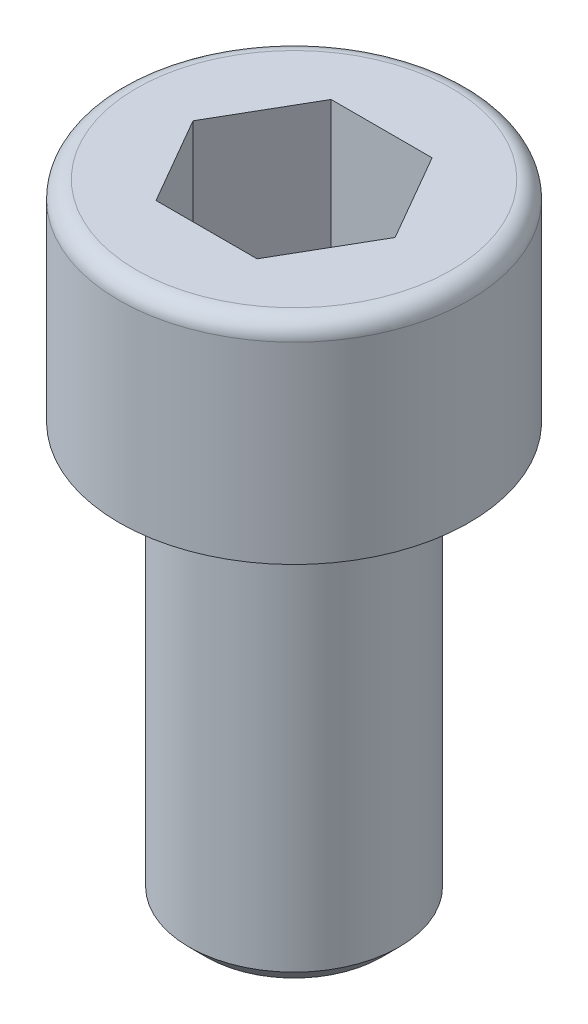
ISO-10303-21;
HEADER;
FILE_DESCRIPTION(('STEP AP214'),'2;1');
FILE_NAME('part.step','',(''),(''),'','','');
FILE_SCHEMA(('AUTOMOTIVE_DESIGN { 1 0 10303 214 1 1 1 1 }'));
ENDSEC;
DATA;
#1=APPLICATION_CONTEXT('core data for automotive mechanical design processes');
#2=APPLICATION_PROTOCOL_DEFINITION('international standard','automotive_design',2000,#1);
#3=PRODUCT_CONTEXT('',#1,'mechanical');
#4=PRODUCT('Part','Part','',(#3));
#5=PRODUCT_RELATED_PRODUCT_CATEGORY('part','',(#4));
#6=PRODUCT_DEFINITION_FORMATION('','',#4);
#7=PRODUCT_DEFINITION_CONTEXT('part definition',#1,'design');
#8=PRODUCT_DEFINITION('design','',#6,#7);
#9=PRODUCT_DEFINITION_SHAPE('','',#8);
#10=(LENGTH_UNIT() NAMED_UNIT(*) SI_UNIT(.MILLI.,.METRE.));
#11=(NAMED_UNIT(*) PLANE_ANGLE_UNIT() SI_UNIT($,.RADIAN.));
#12=(NAMED_UNIT(*) SI_UNIT($,.STERADIAN.) SOLID_ANGLE_UNIT());
#13=UNCERTAINTY_MEASURE_WITH_UNIT(LENGTH_MEASURE(1.E-05),#10,'distance_accuracy_value','');
#14=(GEOMETRIC_REPRESENTATION_CONTEXT(3) GLOBAL_UNCERTAINTY_ASSIGNED_CONTEXT((#13)) GLOBAL_UNIT_ASSIGNED_CONTEXT((#10,
#11,#12)) REPRESENTATION_CONTEXT('',''));
#15=CARTESIAN_POINT('',(0.,0.,0.));
#16=DIRECTION('',(0.,0.,1.));
#17=DIRECTION('',(1.,0.,0.));
#18=AXIS2_PLACEMENT_3D('',#15,#16,#17);
#19=CARTESIAN_POINT('',(-1.11022302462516E-13,18.,0.));
#20=DIRECTION('',(0.,1.,0.));
#21=DIRECTION('',(0.,0.,1.));
#22=AXIS2_PLACEMENT_3D('',#19,#20,#21);
#23=PLANE('',#22);
#24=CARTESIAN_POINT('',(-1.11022302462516E-13,18.,0.));
#25=DIRECTION('',(0.,1.,0.));
#26=DIRECTION('',(0.,0.,1.));
#27=AXIS2_PLACEMENT_3D('',#24,#25,#26);
#28=CIRCLE('',#27,4.5);
#29=CARTESIAN_POINT('',(-1.17882679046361E-13,18.,4.50000000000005));
#30=VERTEX_POINT('',#29);
#31=EDGE_CURVE('E97',#30,#30,#28,.T.);
#32=ORIENTED_EDGE('',*,*,#31,.T.);
#33=EDGE_LOOP('',(#32));
#34=FACE_BOUND('',#33,.T.);
#35=DIRECTION('',(0.499999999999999,0.,0.866025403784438));
#36=VECTOR('',#35,1.);
#37=CARTESIAN_POINT('',(1.44337567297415,17.9999999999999,-2.50000000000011));
#38=LINE('',#37,#36);
#39=CARTESIAN_POINT('',(1.44337567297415,17.9999999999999,-2.50000000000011));
#40=VERTEX_POINT('',#39);
#41=CARTESIAN_POINT('',(2.88675134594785,18.0000000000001,1.0547118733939E-12));
#42=VERTEX_POINT('',#41);
#43=EDGE_CURVE('E102',#40,#42,#38,.T.);
#44=ORIENTED_EDGE('',*,*,#43,.T.);
#45=DIRECTION('',(-0.500000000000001,0.,0.866025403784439));
#46=VECTOR('',#45,1.);
#47=CARTESIAN_POINT('',(2.88675134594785,18.0000000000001,1.0547118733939E-12));
#48=LINE('',#47,#46);
#49=CARTESIAN_POINT('',(1.44337567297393,17.9999999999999,2.49999999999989));
#50=VERTEX_POINT('',#49);
#51=EDGE_CURVE('E43',#42,#50,#48,.T.);
#52=ORIENTED_EDGE('',*,*,#51,.T.);
#53=DIRECTION('',(-1.,0.,0.));
#54=VECTOR('',#53,1.);
#55=CARTESIAN_POINT('',(1.44337567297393,17.9999999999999,2.49999999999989));
#56=LINE('',#55,#54);
#57=CARTESIAN_POINT('',(-1.44337567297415,17.9999999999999,2.49999999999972));
#58=VERTEX_POINT('',#57);
#59=EDGE_CURVE('E83',#50,#58,#56,.T.);
#60=ORIENTED_EDGE('',*,*,#59,.T.);
#61=DIRECTION('',(-0.499999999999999,0.,-0.866025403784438));
#62=VECTOR('',#61,1.);
#63=CARTESIAN_POINT('',(-1.44337567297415,17.9999999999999,2.49999999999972));
#64=LINE('',#63,#62);
#65=CARTESIAN_POINT('',(-2.88675134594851,17.9999999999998,-4.44089209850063E-13));
#66=VERTEX_POINT('',#65);
#67=EDGE_CURVE('E91',#58,#66,#64,.T.);
#68=ORIENTED_EDGE('',*,*,#67,.T.);
#69=DIRECTION('',(0.500000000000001,0.,-0.866025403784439));
#70=VECTOR('',#69,1.);
#71=CARTESIAN_POINT('',(-2.88675134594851,17.9999999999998,-4.44089209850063E-13));
#72=LINE('',#71,#70);
#73=CARTESIAN_POINT('',(-1.44337567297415,18.,-2.5));
#74=VERTEX_POINT('',#73);
#75=EDGE_CURVE('E106',#66,#74,#72,.T.);
#76=ORIENTED_EDGE('',*,*,#75,.T.);
#77=DIRECTION('',(1.,0.,0.));
#78=VECTOR('',#77,1.);
#79=CARTESIAN_POINT('',(-1.44337567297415,18.,-2.5));
#80=LINE('',#79,#78);
#81=EDGE_CURVE('E109',#74,#40,#80,.T.);
#82=ORIENTED_EDGE('',*,*,#81,.T.);
#83=EDGE_LOOP('',(#44,#52,#60,#68,#76,#82));
#84=FACE_BOUND('',#83,.T.);
#85=ADVANCED_FACE('F28',(#34,#84),#23,.T.);
#86=CARTESIAN_POINT('',(-2.99999999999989,2.4980018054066E-13,-4.9960036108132E-13));
#87=DIRECTION('',(0.,-1.,0.));
#88=DIRECTION('',(0.,0.,-1.));
#89=AXIS2_PLACEMENT_3D('',#86,#87,#88);
#90=PLANE('',#89);
#91=CARTESIAN_POINT('',(0.,1.94289029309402E-13,0.));
#92=DIRECTION('',(0.,-1.,0.));
#93=DIRECTION('',(0.,0.,-1.));
#94=AXIS2_PLACEMENT_3D('',#91,#92,#93);
#95=CIRCLE('',#94,2.5);
#96=CARTESIAN_POINT('',(-1.14736926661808E-13,1.95047970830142E-13,2.50000000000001));
#97=VERTEX_POINT('',#96);
#98=EDGE_CURVE('E11',#97,#97,#95,.T.);
#99=ORIENTED_EDGE('',*,*,#98,.T.);
#100=EDGE_LOOP('',(#99));
#101=FACE_BOUND('',#100,.T.);
#102=ADVANCED_FACE('F30',(#101),#90,.T.);
#103=CARTESIAN_POINT('',(1.11022302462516E-13,50.,1.99840144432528E-12));
#104=DIRECTION('',(0.,1.,0.));
#105=DIRECTION('',(0.,0.,1.));
#106=AXIS2_PLACEMENT_3D('',#103,#104,#105);
#107=CYLINDRICAL_SURFACE('',#106,3.);
#108=CARTESIAN_POINT('',(-1.11022302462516E-13,0.500000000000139,0.));
#109=DIRECTION('',(0.,-1.,0.));
#110=DIRECTION('',(0.,0.,-1.));
#111=AXIS2_PLACEMENT_3D('',#108,#109,#110);
#112=CIRCLE('',#111,3.);
#113=CARTESIAN_POINT('',(1.16021634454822E-13,0.500000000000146,3.00000000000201));
#114=VERTEX_POINT('',#113);
#115=EDGE_CURVE('E36',#114,#114,#112,.F.);
#116=CARTESIAN_POINT('',(1.11022302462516E-13,12.,0.));
#117=DIRECTION('',(0.,1.,0.));
#118=DIRECTION('',(0.,0.,1.));
#119=AXIS2_PLACEMENT_3D('',#116,#117,#118);
#120=CIRCLE('',#119,3.);
#121=CARTESIAN_POINT('',(1.13797623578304E-13,12.,3.00000000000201));
#122=VERTEX_POINT('',#121);
#123=EDGE_CURVE('E139',#122,#122,#120,.T.);
#124=CARTESIAN_POINT('',(1.16021634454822E-13,0.500000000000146,3.00000000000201));
#125=CARTESIAN_POINT('',(1.15998467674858E-13,0.619791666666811,3.00000000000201));
#126=CARTESIAN_POINT('',(1.15975300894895E-13,0.739583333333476,3.00000000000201));
#127=CARTESIAN_POINT('',(1.15928967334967E-13,0.979166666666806,3.00000000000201));
#128=CARTESIAN_POINT('',(1.15905800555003E-13,1.09895833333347,3.00000000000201));
#129=CARTESIAN_POINT('',(1.15859466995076E-13,1.3385416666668,3.00000000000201));
#130=CARTESIAN_POINT('',(1.15836300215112E-13,1.45833333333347,3.00000000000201));
#131=CARTESIAN_POINT('',(1.15789966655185E-13,1.6979166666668,3.00000000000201));
#132=CARTESIAN_POINT('',(1.15766799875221E-13,1.81770833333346,3.00000000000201));
#133=CARTESIAN_POINT('',(1.15720466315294E-13,2.05729166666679,3.00000000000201));
#134=CARTESIAN_POINT('',(1.1569729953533E-13,2.17708333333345,3.00000000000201));
#135=CARTESIAN_POINT('',(1.15650965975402E-13,2.41666666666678,3.00000000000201));
#136=CARTESIAN_POINT('',(1.15627799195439E-13,2.53645833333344,3.00000000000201));
#137=CARTESIAN_POINT('',(1.15581465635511E-13,2.77604166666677,3.00000000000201));
#138=CARTESIAN_POINT('',(1.15558298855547E-13,2.89583333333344,3.00000000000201));
#139=CARTESIAN_POINT('',(1.1551196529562E-13,3.13541666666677,3.00000000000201));
#140=CARTESIAN_POINT('',(1.15488798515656E-13,3.25520833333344,3.00000000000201));
#141=CARTESIAN_POINT('',(1.15442464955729E-13,3.49479166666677,3.00000000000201));
#142=CARTESIAN_POINT('',(1.15419298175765E-13,3.61458333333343,3.00000000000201));
#143=CARTESIAN_POINT('',(1.15372964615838E-13,3.85416666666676,3.00000000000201));
#144=CARTESIAN_POINT('',(1.15349797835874E-13,3.97395833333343,3.00000000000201));
#145=CARTESIAN_POINT('',(1.15303464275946E-13,4.21354166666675,3.00000000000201));
#146=CARTESIAN_POINT('',(1.15280297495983E-13,4.33333333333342,3.00000000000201));
#147=CARTESIAN_POINT('',(1.15233963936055E-13,4.57291666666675,3.00000000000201));
#148=CARTESIAN_POINT('',(1.15210797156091E-13,4.69270833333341,3.00000000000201));
#149=CARTESIAN_POINT('',(1.15164463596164E-13,4.93229166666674,3.00000000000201));
#150=CARTESIAN_POINT('',(1.151412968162E-13,5.0520833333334,3.00000000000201));
#151=CARTESIAN_POINT('',(1.15094963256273E-13,5.29166666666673,3.00000000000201));
#152=CARTESIAN_POINT('',(1.15071796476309E-13,5.4114583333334,3.00000000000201));
#153=CARTESIAN_POINT('',(1.15025462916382E-13,5.65104166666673,3.00000000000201));
#154=CARTESIAN_POINT('',(1.15002296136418E-13,5.77083333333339,3.00000000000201));
#155=CARTESIAN_POINT('',(1.1495596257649E-13,6.01041666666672,3.00000000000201));
#156=CARTESIAN_POINT('',(1.14932795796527E-13,6.13020833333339,3.00000000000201));
#157=CARTESIAN_POINT('',(1.14886462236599E-13,6.36979166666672,3.00000000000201));
#158=CARTESIAN_POINT('',(1.14863295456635E-13,6.48958333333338,3.00000000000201));
#159=CARTESIAN_POINT('',(1.14816961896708E-13,6.72916666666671,3.00000000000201));
#160=CARTESIAN_POINT('',(1.14793795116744E-13,6.84895833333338,3.00000000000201));
#161=CARTESIAN_POINT('',(1.14747461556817E-13,7.08854166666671,3.00000000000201));
#162=CARTESIAN_POINT('',(1.14724294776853E-13,7.20833333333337,3.00000000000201));
#163=CARTESIAN_POINT('',(1.14677961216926E-13,7.4479166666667,3.00000000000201));
#164=CARTESIAN_POINT('',(1.14654794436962E-13,7.56770833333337,3.00000000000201));
#165=CARTESIAN_POINT('',(1.14608460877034E-13,7.8072916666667,3.00000000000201));
#166=CARTESIAN_POINT('',(1.14585294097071E-13,7.92708333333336,3.00000000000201));
#167=CARTESIAN_POINT('',(1.14538960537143E-13,8.16666666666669,3.00000000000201));
#168=CARTESIAN_POINT('',(1.14515793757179E-13,8.28645833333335,3.00000000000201));
#169=CARTESIAN_POINT('',(1.14469460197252E-13,8.52604166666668,3.00000000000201));
#170=CARTESIAN_POINT('',(1.14446293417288E-13,8.64583333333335,3.00000000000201));
#171=CARTESIAN_POINT('',(1.14399959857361E-13,8.88541666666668,3.00000000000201));
#172=CARTESIAN_POINT('',(1.14376793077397E-13,9.00520833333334,3.00000000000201));
#173=CARTESIAN_POINT('',(1.1433045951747E-13,9.24479166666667,3.00000000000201));
#174=CARTESIAN_POINT('',(1.14307292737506E-13,9.36458333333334,3.00000000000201));
#175=CARTESIAN_POINT('',(1.14260959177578E-13,9.60416666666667,3.00000000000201));
#176=CARTESIAN_POINT('',(1.14237792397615E-13,9.72395833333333,3.00000000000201));
#177=CARTESIAN_POINT('',(1.14191458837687E-13,9.96354166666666,3.00000000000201));
#178=CARTESIAN_POINT('',(1.14168292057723E-13,10.0833333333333,3.00000000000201));
#179=CARTESIAN_POINT('',(1.14121958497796E-13,10.3229166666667,3.00000000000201));
#180=CARTESIAN_POINT('',(1.14098791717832E-13,10.4427083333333,3.00000000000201));
#181=CARTESIAN_POINT('',(1.14052458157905E-13,10.6822916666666,3.00000000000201));
#182=CARTESIAN_POINT('',(1.14029291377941E-13,10.8020833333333,3.00000000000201));
#183=CARTESIAN_POINT('',(1.13982957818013E-13,11.0416666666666,3.00000000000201));
#184=CARTESIAN_POINT('',(1.1395979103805E-13,11.1614583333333,3.00000000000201));
#185=CARTESIAN_POINT('',(1.13913457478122E-13,11.4010416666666,3.00000000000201));
#186=CARTESIAN_POINT('',(1.13890290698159E-13,11.5208333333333,3.00000000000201));
#187=CARTESIAN_POINT('',(1.13843957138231E-13,11.7604166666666,3.00000000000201));
#188=CARTESIAN_POINT('',(1.13820790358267E-13,11.8802083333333,3.00000000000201));
#189=CARTESIAN_POINT('',(1.13797623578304E-13,12.,3.00000000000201));
#190=B_SPLINE_CURVE_WITH_KNOTS('',3,(#124,#125,#126,#127,#128,#129,#130,#131,#132,#133,#134,
#135,#136,#137,#138,#139,#140,#141,#142,#143,#144,#145,#146,#147,#148,#149,#150,#151,#152,#153,
#154,#155,#156,#157,#158,#159,#160,#161,#162,#163,#164,#165,#166,#167,#168,#169,#170,#171,#172,
#173,#174,#175,#176,#177,#178,#179,#180,#181,#182,#183,#184,#185,#186,#187,#188,#189),
.UNSPECIFIED.,.F.,.F.,(4,2,2,2,2,2,2,2,2,2,2,2,2,2,2,2,2,2,2,2,2,2,2,2,2,2,2,2,2,2,2,2,4),(0.,
0.359374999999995,0.71874999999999,1.07812499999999,1.43749999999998,1.79687499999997,
2.15624999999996,2.51562499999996,2.87499999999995,3.23437499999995,3.59374999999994,
3.95312499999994,4.31249999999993,4.67187499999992,5.03124999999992,5.39062499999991,
5.74999999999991,6.1093749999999,6.4687499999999,6.82812499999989,7.18749999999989,
7.54687499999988,7.90624999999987,8.26562499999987,8.62499999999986,8.98437499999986,
9.34374999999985,9.70312499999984,10.0624999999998,10.4218749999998,10.7812499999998,
11.1406249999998,11.4999999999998),.UNSPECIFIED.);
#191=EDGE_CURVE('BSEAM144',#114,#122,#190,.T.);
#192=ORIENTED_EDGE('',*,*,#115,.T.);
#193=ORIENTED_EDGE('',*,*,#123,.F.);
#194=ORIENTED_EDGE('',*,*,#191,.T.);
#195=ORIENTED_EDGE('',*,*,#191,.F.);
#196=EDGE_LOOP('',(#192,#194,#193,#195));
#197=FACE_BOUND('',#196,.T.);
#198=ADVANCED_FACE('F144',(#197),#107,.T.);
#199=CARTESIAN_POINT('',(-4.99999999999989,11.9999999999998,-3.33066907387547E-13));
#200=DIRECTION('',(0.,-1.,0.));
#201=DIRECTION('',(0.,0.,-1.));
#202=AXIS2_PLACEMENT_3D('',#199,#200,#201);
#203=PLANE('',#202);
#204=ORIENTED_EDGE('',*,*,#123,.T.);
#205=EDGE_LOOP('',(#204));
#206=FACE_BOUND('',#205,.T.);
#207=CARTESIAN_POINT('',(1.11022302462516E-13,12.,0.));
#208=DIRECTION('',(0.,1.,0.));
#209=DIRECTION('',(0.,0.,1.));
#210=AXIS2_PLACEMENT_3D('',#207,#208,#209);
#211=CIRCLE('',#210,5.);
#212=CARTESIAN_POINT('',(1.10748567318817E-13,12.,5.000000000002));
#213=VERTEX_POINT('',#212);
#214=EDGE_CURVE('E136',#213,#213,#211,.T.);
#215=ORIENTED_EDGE('',*,*,#214,.F.);
#216=EDGE_LOOP('',(#215));
#217=FACE_BOUND('',#216,.T.);
#218=ADVANCED_FACE('F176',(#206,#217),#203,.T.);
#219=CARTESIAN_POINT('',(1.11022302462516E-13,50.,1.99840144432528E-12));
#220=DIRECTION('',(0.,1.,0.));
#221=DIRECTION('',(0.,0.,1.));
#222=AXIS2_PLACEMENT_3D('',#219,#220,#221);
#223=CYLINDRICAL_SURFACE('',#222,5.);
#224=CARTESIAN_POINT('',(-3.33066907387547E-13,17.5,0.));
#225=DIRECTION('',(0.,1.,0.));
#226=DIRECTION('',(0.,0.,1.));
#227=AXIS2_PLACEMENT_3D('',#224,#225,#226);
#228=CIRCLE('',#227,5.);
#229=CARTESIAN_POINT('',(1.09684909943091E-13,17.5,5.000000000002));
#230=VERTEX_POINT('',#229);
#231=EDGE_CURVE('E133',#230,#230,#228,.T.);
#232=CARTESIAN_POINT('',(1.10748567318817E-13,12.,5.000000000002));
#233=CARTESIAN_POINT('',(1.10737487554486E-13,12.0572916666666,5.000000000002));
#234=CARTESIAN_POINT('',(1.10726407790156E-13,12.1145833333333,5.000000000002));
#235=CARTESIAN_POINT('',(1.10704248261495E-13,12.2291666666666,5.000000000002));
#236=CARTESIAN_POINT('',(1.10693168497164E-13,12.2864583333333,5.000000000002));
#237=CARTESIAN_POINT('',(1.10671008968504E-13,12.4010416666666,5.000000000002));
#238=CARTESIAN_POINT('',(1.10659929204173E-13,12.4583333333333,5.000000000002));
#239=CARTESIAN_POINT('',(1.10637769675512E-13,12.5729166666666,5.000000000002));
#240=CARTESIAN_POINT('',(1.10626689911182E-13,12.6302083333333,5.000000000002));
#241=CARTESIAN_POINT('',(1.10604530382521E-13,12.7447916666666,5.000000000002));
#242=CARTESIAN_POINT('',(1.1059345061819E-13,12.8020833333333,5.000000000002));
#243=CARTESIAN_POINT('',(1.10571291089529E-13,12.9166666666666,5.000000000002));
#244=CARTESIAN_POINT('',(1.10560211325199E-13,12.9739583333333,5.000000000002));
#245=CARTESIAN_POINT('',(1.10538051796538E-13,13.0885416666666,5.000000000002));
#246=CARTESIAN_POINT('',(1.10526972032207E-13,13.1458333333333,5.000000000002));
#247=CARTESIAN_POINT('',(1.10504812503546E-13,13.2604166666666,5.000000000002));
#248=CARTESIAN_POINT('',(1.10493732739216E-13,13.3177083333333,5.000000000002));
#249=CARTESIAN_POINT('',(1.10471573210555E-13,13.4322916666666,5.000000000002));
#250=CARTESIAN_POINT('',(1.10460493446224E-13,13.4895833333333,5.000000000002));
#251=CARTESIAN_POINT('',(1.10438333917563E-13,13.6041666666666,5.000000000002));
#252=CARTESIAN_POINT('',(1.10427254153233E-13,13.6614583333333,5.000000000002));
#253=CARTESIAN_POINT('',(1.10405094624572E-13,13.7760416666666,5.000000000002));
#254=CARTESIAN_POINT('',(1.10394014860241E-13,13.8333333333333,5.000000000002));
#255=CARTESIAN_POINT('',(1.10371855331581E-13,13.9479166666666,5.000000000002));
#256=CARTESIAN_POINT('',(1.1036077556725E-13,14.0052083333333,5.000000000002));
#257=CARTESIAN_POINT('',(1.10338616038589E-13,14.1197916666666,5.000000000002));
#258=CARTESIAN_POINT('',(1.10327536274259E-13,14.1770833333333,5.000000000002));
#259=CARTESIAN_POINT('',(1.10305376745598E-13,14.2916666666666,5.000000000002));
#260=CARTESIAN_POINT('',(1.10294296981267E-13,14.3489583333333,5.000000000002));
#261=CARTESIAN_POINT('',(1.10272137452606E-13,14.4635416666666,5.000000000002));
#262=CARTESIAN_POINT('',(1.10261057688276E-13,14.5208333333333,5.000000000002));
#263=CARTESIAN_POINT('',(1.10238898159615E-13,14.6354166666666,5.000000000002));
#264=CARTESIAN_POINT('',(1.10227818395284E-13,14.6927083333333,5.000000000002));
#265=CARTESIAN_POINT('',(1.10205658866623E-13,14.8072916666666,5.000000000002));
#266=CARTESIAN_POINT('',(1.10194579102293E-13,14.8645833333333,5.000000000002));
#267=CARTESIAN_POINT('',(1.10172419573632E-13,14.9791666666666,5.000000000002));
#268=CARTESIAN_POINT('',(1.10161339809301E-13,15.0364583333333,5.000000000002));
#269=CARTESIAN_POINT('',(1.1013918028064E-13,15.1510416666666,5.000000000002));
#270=CARTESIAN_POINT('',(1.1012810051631E-13,15.2083333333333,5.000000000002));
#271=CARTESIAN_POINT('',(1.10105940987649E-13,15.3229166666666,5.000000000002));
#272=CARTESIAN_POINT('',(1.10094861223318E-13,15.3802083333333,5.000000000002));
#273=CARTESIAN_POINT('',(1.10072701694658E-13,15.4947916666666,5.000000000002));
#274=CARTESIAN_POINT('',(1.10061621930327E-13,15.5520833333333,5.000000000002));
#275=CARTESIAN_POINT('',(1.10039462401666E-13,15.6666666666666,5.000000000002));
#276=CARTESIAN_POINT('',(1.10028382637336E-13,15.7239583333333,5.000000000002));
#277=CARTESIAN_POINT('',(1.10006223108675E-13,15.8385416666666,5.000000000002));
#278=CARTESIAN_POINT('',(1.09995143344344E-13,15.8958333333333,5.000000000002));
#279=CARTESIAN_POINT('',(1.09972983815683E-13,16.0104166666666,5.000000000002));
#280=CARTESIAN_POINT('',(1.09961904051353E-13,16.0677083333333,5.000000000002));
#281=CARTESIAN_POINT('',(1.09939744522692E-13,16.1822916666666,5.000000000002));
#282=CARTESIAN_POINT('',(1.09928664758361E-13,16.2395833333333,5.000000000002));
#283=CARTESIAN_POINT('',(1.099065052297E-13,16.3541666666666,5.000000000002));
#284=CARTESIAN_POINT('',(1.0989542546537E-13,16.4114583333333,5.000000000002));
#285=CARTESIAN_POINT('',(1.09873265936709E-13,16.5260416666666,5.000000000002));
#286=CARTESIAN_POINT('',(1.09862186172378E-13,16.5833333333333,5.000000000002));
#287=CARTESIAN_POINT('',(1.09840026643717E-13,16.6979166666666,5.000000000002));
#288=CARTESIAN_POINT('',(1.09828946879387E-13,16.7552083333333,5.000000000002));
#289=CARTESIAN_POINT('',(1.09806787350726E-13,16.8697916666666,5.000000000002));
#290=CARTESIAN_POINT('',(1.09795707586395E-13,16.9270833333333,5.000000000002));
#291=CARTESIAN_POINT('',(1.09773548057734E-13,17.0416666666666,5.000000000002));
#292=CARTESIAN_POINT('',(1.09762468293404E-13,17.0989583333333,5.000000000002));
#293=CARTESIAN_POINT('',(1.09740308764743E-13,17.2135416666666,5.000000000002));
#294=CARTESIAN_POINT('',(1.09729229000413E-13,17.2708333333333,5.000000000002));
#295=CARTESIAN_POINT('',(1.09707069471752E-13,17.3854166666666,5.000000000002));
#296=CARTESIAN_POINT('',(1.09695989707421E-13,17.4427083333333,5.000000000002));
#297=CARTESIAN_POINT('',(1.09684909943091E-13,17.5,5.000000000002));
#298=B_SPLINE_CURVE_WITH_KNOTS('',3,(#232,#233,#234,#235,#236,#237,#238,#239,#240,#241,#242,
#243,#244,#245,#246,#247,#248,#249,#250,#251,#252,#253,#254,#255,#256,#257,#258,#259,#260,#261,
#262,#263,#264,#265,#266,#267,#268,#269,#270,#271,#272,#273,#274,#275,#276,#277,#278,#279,#280,
#281,#282,#283,#284,#285,#286,#287,#288,#289,#290,#291,#292,#293,#294,#295,#296,#297),
.UNSPECIFIED.,.F.,.F.,(4,2,2,2,2,2,2,2,2,2,2,2,2,2,2,2,2,2,2,2,2,2,2,2,2,2,2,2,2,2,2,2,4),(0.,
0.171875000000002,0.343750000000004,0.515624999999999,0.687500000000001,0.859375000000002,
1.03125,1.203125,1.375,1.546875,1.71875,1.890625,2.0625,2.234375,2.40625,2.578125,2.75,2.921875,
3.09375000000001,3.265625,3.4375,3.609375,3.78125,3.953125,4.125,4.29687500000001,
4.46875000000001,4.640625,4.8125,4.98437500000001,5.15625,5.328125,5.50000000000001),.UNSPECIFIED.);
#299=EDGE_CURVE('BSEAM172',#213,#230,#298,.T.);
#300=ORIENTED_EDGE('',*,*,#214,.T.);
#301=ORIENTED_EDGE('',*,*,#231,.F.);
#302=ORIENTED_EDGE('',*,*,#299,.T.);
#303=ORIENTED_EDGE('',*,*,#299,.F.);
#304=EDGE_LOOP('',(#300,#302,#301,#303));
#305=FACE_BOUND('',#304,.T.);
#306=ADVANCED_FACE('F172',(#305),#223,.T.);
#307=CARTESIAN_POINT('',(-3.33066907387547E-13,17.5,0.));
#308=DIRECTION('',(0.,1.,0.));
#309=DIRECTION('',(0.,0.,1.));
#310=AXIS2_PLACEMENT_3D('',#307,#308,#309);
#311=TOROIDAL_SURFACE('',#310,4.5,0.5);
#312=ORIENTED_EDGE('',*,*,#31,.F.);
#313=EDGE_LOOP('',(#312));
#314=FACE_BOUND('',#313,.T.);
#315=ORIENTED_EDGE('',*,*,#231,.T.);
#316=EDGE_LOOP('',(#315));
#317=FACE_BOUND('',#316,.T.);
#318=ADVANCED_FACE('F169',(#314,#317),#311,.T.);
#319=CARTESIAN_POINT('',(2.88675134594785,14.0000000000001,9.43689570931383E-13));
#320=DIRECTION('',(-0.866025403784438,0.,-0.499999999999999));
#321=DIRECTION('',(-0.500000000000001,0.,0.866025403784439));
#322=AXIS2_PLACEMENT_3D('',#319,#320,#321);
#323=PLANE('',#322);
#324=ORIENTED_EDGE('',*,*,#51,.F.);
#325=DIRECTION('',(0.,1.,0.));
#326=VECTOR('',#325,1.);
#327=CARTESIAN_POINT('',(2.88675134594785,14.0000000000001,9.43689570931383E-13));
#328=LINE('',#327,#326);
#329=CARTESIAN_POINT('',(2.88675134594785,14.0000000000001,9.43689570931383E-13));
#330=VERTEX_POINT('',#329);
#331=EDGE_CURVE('E122',#330,#42,#328,.T.);
#332=ORIENTED_EDGE('',*,*,#331,.F.);
#333=DIRECTION('',(-0.500000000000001,0.,0.866025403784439));
#334=VECTOR('',#333,1.);
#335=CARTESIAN_POINT('',(2.88675134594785,14.0000000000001,9.43689570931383E-13));
#336=LINE('',#335,#334);
#337=CARTESIAN_POINT('',(1.44337567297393,14.0000000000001,2.49999999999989));
#338=VERTEX_POINT('',#337);
#339=EDGE_CURVE('E96',#330,#338,#336,.T.);
#340=ORIENTED_EDGE('',*,*,#339,.T.);
#341=DIRECTION('',(0.,1.,0.));
#342=VECTOR('',#341,1.);
#343=CARTESIAN_POINT('',(1.44337567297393,14.0000000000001,2.49999999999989));
#344=LINE('',#343,#342);
#345=EDGE_CURVE('E85',#338,#50,#344,.T.);
#346=ORIENTED_EDGE('',*,*,#345,.T.);
#347=EDGE_LOOP('',(#324,#332,#340,#346));
#348=FACE_BOUND('',#347,.T.);
#349=ADVANCED_FACE('F94',(#348),#323,.T.);
#350=CARTESIAN_POINT('',(1.44337567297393,14.0000000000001,2.49999999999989));
#351=DIRECTION('',(0.,0.,-1.));
#352=DIRECTION('',(-1.,0.,0.));
#353=AXIS2_PLACEMENT_3D('',#350,#351,#352);
#354=PLANE('',#353);
#355=ORIENTED_EDGE('',*,*,#59,.F.);
#356=ORIENTED_EDGE('',*,*,#345,.F.);
#357=DIRECTION('',(-1.,0.,0.));
#358=VECTOR('',#357,1.);
#359=CARTESIAN_POINT('',(1.44337567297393,14.0000000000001,2.49999999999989));
#360=LINE('',#359,#358);
#361=CARTESIAN_POINT('',(-1.44337567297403,14.0000000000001,2.49999999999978));
#362=VERTEX_POINT('',#361);
#363=EDGE_CURVE('E113',#338,#362,#360,.T.);
#364=ORIENTED_EDGE('',*,*,#363,.T.);
#365=DIRECTION('',(0.,1.,0.));
#366=VECTOR('',#365,1.);
#367=CARTESIAN_POINT('',(-1.44337567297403,14.0000000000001,2.49999999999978));
#368=LINE('',#367,#366);
#369=EDGE_CURVE('E87',#362,#58,#368,.T.);
#370=ORIENTED_EDGE('',*,*,#369,.T.);
#371=EDGE_LOOP('',(#355,#356,#364,#370));
#372=FACE_BOUND('',#371,.T.);
#373=ADVANCED_FACE('F84',(#372),#354,.T.);
#374=CARTESIAN_POINT('',(-1.44337567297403,14.0000000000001,2.49999999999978));
#375=DIRECTION('',(0.866025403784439,0.,-0.500000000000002));
#376=DIRECTION('',(-0.499999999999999,0.,-0.866025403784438));
#377=AXIS2_PLACEMENT_3D('',#374,#375,#376);
#378=PLANE('',#377);
#379=ORIENTED_EDGE('',*,*,#67,.F.);
#380=ORIENTED_EDGE('',*,*,#369,.F.);
#381=DIRECTION('',(-0.499999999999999,0.,-0.866025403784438));
#382=VECTOR('',#381,1.);
#383=CARTESIAN_POINT('',(-1.44337567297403,14.0000000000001,2.49999999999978));
#384=LINE('',#383,#382);
#385=CARTESIAN_POINT('',(-2.8867513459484,13.9999999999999,-4.44089209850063E-13));
#386=VERTEX_POINT('',#385);
#387=EDGE_CURVE('E115',#362,#386,#384,.T.);
#388=ORIENTED_EDGE('',*,*,#387,.T.);
#389=DIRECTION('',(0.,1.,0.));
#390=VECTOR('',#389,1.);
#391=CARTESIAN_POINT('',(-2.8867513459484,13.9999999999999,-4.44089209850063E-13));
#392=LINE('',#391,#390);
#393=EDGE_CURVE('E128',#386,#66,#392,.T.);
#394=ORIENTED_EDGE('',*,*,#393,.T.);
#395=EDGE_LOOP('',(#379,#380,#388,#394));
#396=FACE_BOUND('',#395,.T.);
#397=ADVANCED_FACE('F208',(#396),#378,.T.);
#398=CARTESIAN_POINT('',(-2.8867513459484,13.9999999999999,-4.44089209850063E-13));
#399=DIRECTION('',(0.866025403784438,0.,0.499999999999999));
#400=DIRECTION('',(0.500000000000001,0.,-0.866025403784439));
#401=AXIS2_PLACEMENT_3D('',#398,#399,#400);
#402=PLANE('',#401);
#403=ORIENTED_EDGE('',*,*,#75,.F.);
#404=ORIENTED_EDGE('',*,*,#393,.F.);
#405=DIRECTION('',(0.500000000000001,0.,-0.866025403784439));
#406=VECTOR('',#405,1.);
#407=CARTESIAN_POINT('',(-2.8867513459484,13.9999999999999,-4.44089209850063E-13));
#408=LINE('',#407,#406);
#409=CARTESIAN_POINT('',(-1.44337567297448,13.9999999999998,-2.5));
#410=VERTEX_POINT('',#409);
#411=EDGE_CURVE('E117',#386,#410,#408,.T.);
#412=ORIENTED_EDGE('',*,*,#411,.T.);
#413=DIRECTION('',(0.,1.,0.));
#414=VECTOR('',#413,1.);
#415=CARTESIAN_POINT('',(-1.44337567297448,13.9999999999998,-2.5));
#416=LINE('',#415,#414);
#417=EDGE_CURVE('E126',#410,#74,#416,.T.);
#418=ORIENTED_EDGE('',*,*,#417,.T.);
#419=EDGE_LOOP('',(#403,#404,#412,#418));
#420=FACE_BOUND('',#419,.T.);
#421=ADVANCED_FACE('F214',(#420),#402,.T.);
#422=CARTESIAN_POINT('',(-1.44337567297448,13.9999999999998,-2.5));
#423=DIRECTION('',(0.,0.,1.));
#424=DIRECTION('',(1.,0.,0.));
#425=AXIS2_PLACEMENT_3D('',#422,#423,#424);
#426=PLANE('',#425);
#427=ORIENTED_EDGE('',*,*,#81,.F.);
#428=ORIENTED_EDGE('',*,*,#417,.F.);
#429=DIRECTION('',(1.,0.,0.));
#430=VECTOR('',#429,1.);
#431=CARTESIAN_POINT('',(-1.44337567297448,13.9999999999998,-2.5));
#432=LINE('',#431,#430);
#433=CARTESIAN_POINT('',(1.44337567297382,13.9999999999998,-2.50000000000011));
#434=VERTEX_POINT('',#433);
#435=EDGE_CURVE('E119',#410,#434,#432,.T.);
#436=ORIENTED_EDGE('',*,*,#435,.T.);
#437=DIRECTION('',(0.,1.,0.));
#438=VECTOR('',#437,1.);
#439=CARTESIAN_POINT('',(1.44337567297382,13.9999999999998,-2.50000000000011));
#440=LINE('',#439,#438);
#441=EDGE_CURVE('E124',#434,#40,#440,.T.);
#442=ORIENTED_EDGE('',*,*,#441,.T.);
#443=EDGE_LOOP('',(#427,#428,#436,#442));
#444=FACE_BOUND('',#443,.T.);
#445=ADVANCED_FACE('F222',(#444),#426,.T.);
#446=CARTESIAN_POINT('',(1.44337567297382,13.9999999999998,-2.50000000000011));
#447=DIRECTION('',(-0.866025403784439,0.,0.500000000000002));
#448=DIRECTION('',(0.499999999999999,0.,0.866025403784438));
#449=AXIS2_PLACEMENT_3D('',#446,#447,#448);
#450=PLANE('',#449);
#451=ORIENTED_EDGE('',*,*,#43,.F.);
#452=ORIENTED_EDGE('',*,*,#441,.F.);
#453=DIRECTION('',(0.499999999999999,0.,0.866025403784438));
#454=VECTOR('',#453,1.);
#455=CARTESIAN_POINT('',(1.44337567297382,13.9999999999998,-2.50000000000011));
#456=LINE('',#455,#454);
#457=EDGE_CURVE('E50',#434,#330,#456,.T.);
#458=ORIENTED_EDGE('',*,*,#457,.T.);
#459=ORIENTED_EDGE('',*,*,#331,.T.);
#460=EDGE_LOOP('',(#451,#452,#458,#459));
#461=FACE_BOUND('',#460,.T.);
#462=ADVANCED_FACE('F155',(#461),#450,.T.);
#463=CARTESIAN_POINT('',(2.88675134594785,14.0000000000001,9.43689570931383E-13));
#464=DIRECTION('',(0.,1.,0.));
#465=DIRECTION('',(0.,0.,1.));
#466=AXIS2_PLACEMENT_3D('',#463,#464,#465);
#467=PLANE('',#466);
#468=ORIENTED_EDGE('',*,*,#339,.F.);
#469=ORIENTED_EDGE('',*,*,#457,.F.);
#470=ORIENTED_EDGE('',*,*,#435,.F.);
#471=ORIENTED_EDGE('',*,*,#411,.F.);
#472=ORIENTED_EDGE('',*,*,#387,.F.);
#473=ORIENTED_EDGE('',*,*,#363,.F.);
#474=EDGE_LOOP('',(#468,#469,#470,#471,#472,#473));
#475=FACE_BOUND('',#474,.T.);
#476=ADVANCED_FACE('F149',(#475),#467,.T.);
#477=CARTESIAN_POINT('',(-1.11022302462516E-13,0.500000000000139,0.));
#478=DIRECTION('',(0.,1.,0.));
#479=DIRECTION('',(0.,0.,1.));
#480=AXIS2_PLACEMENT_3D('',#477,#478,#479);
#481=CONICAL_SURFACE('',#480,3.,0.785398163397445);
#482=CARTESIAN_POINT('',(-1.14736926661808E-13,1.95047970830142E-13,2.50000000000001));
#483=CARTESIAN_POINT('',(-1.14745874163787E-13,0.00520833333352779,2.50520833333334));
#484=CARTESIAN_POINT('',(-1.14754821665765E-13,0.0104166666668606,2.51041666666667));
#485=CARTESIAN_POINT('',(-1.14772716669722E-13,0.0208333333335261,2.52083333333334));
#486=CARTESIAN_POINT('',(-1.14781664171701E-13,0.0260416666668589,2.52604166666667));
#487=CARTESIAN_POINT('',(-1.14799559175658E-13,0.0364583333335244,2.53645833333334));
#488=CARTESIAN_POINT('',(-1.14808506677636E-13,0.0416666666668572,2.54166666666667));
#489=CARTESIAN_POINT('',(-1.14826401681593E-13,0.0520833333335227,2.55208333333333));
#490=CARTESIAN_POINT('',(-1.14835349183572E-13,0.0572916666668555,2.55729166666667));
#491=CARTESIAN_POINT('',(-1.14853244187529E-13,0.0677083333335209,2.56770833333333));
#492=CARTESIAN_POINT('',(-1.14862191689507E-13,0.0729166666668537,2.57291666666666));
#493=CARTESIAN_POINT('',(-1.14880086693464E-13,0.0833333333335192,2.58333333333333));
#494=CARTESIAN_POINT('',(-1.14889034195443E-13,0.0885416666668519,2.58854166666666));
#495=CARTESIAN_POINT('',(-1.149069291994E-13,0.0989583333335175,2.59895833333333));
#496=CARTESIAN_POINT('',(-1.14915876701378E-13,0.10416666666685,2.60416666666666));
#497=CARTESIAN_POINT('',(-1.14933771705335E-13,0.114583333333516,2.61458333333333));
#498=CARTESIAN_POINT('',(-1.14942719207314E-13,0.119791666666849,2.61979166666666));
#499=CARTESIAN_POINT('',(-1.14960614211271E-13,0.130208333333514,2.63020833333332));
#500=CARTESIAN_POINT('',(-1.1496956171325E-13,0.135416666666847,2.63541666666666));
#501=CARTESIAN_POINT('',(-1.14987456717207E-13,0.145833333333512,2.64583333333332));
#502=CARTESIAN_POINT('',(-1.14996404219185E-13,0.151041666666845,2.65104166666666));
#503=CARTESIAN_POINT('',(-1.15014299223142E-13,0.161458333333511,2.66145833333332));
#504=CARTESIAN_POINT('',(-1.15023246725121E-13,0.166666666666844,2.66666666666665));
#505=CARTESIAN_POINT('',(-1.15041141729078E-13,0.177083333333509,2.67708333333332));
#506=CARTESIAN_POINT('',(-1.15050089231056E-13,0.182291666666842,2.68229166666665));
#507=CARTESIAN_POINT('',(-1.15067984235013E-13,0.192708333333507,2.69270833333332));
#508=CARTESIAN_POINT('',(-1.15076931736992E-13,0.19791666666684,2.69791666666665));
#509=CARTESIAN_POINT('',(-1.15094826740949E-13,0.208333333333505,2.70833333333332));
#510=CARTESIAN_POINT('',(-1.15103774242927E-13,0.213541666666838,2.71354166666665));
#511=CARTESIAN_POINT('',(-1.15121669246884E-13,0.223958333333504,2.72395833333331));
#512=CARTESIAN_POINT('',(-1.15130616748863E-13,0.229166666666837,2.72916666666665));
#513=CARTESIAN_POINT('',(-1.1514851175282E-13,0.239583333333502,2.73958333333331));
#514=CARTESIAN_POINT('',(-1.15157459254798E-13,0.244791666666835,2.74479166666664));
#515=CARTESIAN_POINT('',(-1.15175354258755E-13,0.2552083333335,2.75520833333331));
#516=CARTESIAN_POINT('',(-1.15184301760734E-13,0.260416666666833,2.76041666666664));
#517=CARTESIAN_POINT('',(-1.15202196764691E-13,0.270833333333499,2.77083333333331));
#518=CARTESIAN_POINT('',(-1.1521114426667E-13,0.276041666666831,2.77604166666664));
#519=CARTESIAN_POINT('',(-1.15229039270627E-13,0.286458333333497,2.78645833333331));
#520=CARTESIAN_POINT('',(-1.15237986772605E-13,0.29166666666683,2.79166666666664));
#521=CARTESIAN_POINT('',(-1.15255881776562E-13,0.302083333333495,2.8020833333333));
#522=CARTESIAN_POINT('',(-1.15264829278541E-13,0.307291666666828,2.80729166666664));
#523=CARTESIAN_POINT('',(-1.15282724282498E-13,0.317708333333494,2.8177083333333));
#524=CARTESIAN_POINT('',(-1.15291671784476E-13,0.322916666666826,2.82291666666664));
#525=CARTESIAN_POINT('',(-1.15309566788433E-13,0.333333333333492,2.8333333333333));
#526=CARTESIAN_POINT('',(-1.15318514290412E-13,0.338541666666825,2.83854166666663));
#527=CARTESIAN_POINT('',(-1.15336409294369E-13,0.34895833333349,2.8489583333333));
#528=CARTESIAN_POINT('',(-1.15345356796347E-13,0.354166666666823,2.85416666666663));
#529=CARTESIAN_POINT('',(-1.15363251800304E-13,0.364583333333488,2.8645833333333));
#530=CARTESIAN_POINT('',(-1.15372199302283E-13,0.369791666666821,2.86979166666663));
#531=CARTESIAN_POINT('',(-1.1539009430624E-13,0.380208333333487,2.8802083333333));
#532=CARTESIAN_POINT('',(-1.15399041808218E-13,0.385416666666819,2.88541666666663));
#533=CARTESIAN_POINT('',(-1.15416936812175E-13,0.395833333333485,2.89583333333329));
#534=CARTESIAN_POINT('',(-1.15425884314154E-13,0.401041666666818,2.90104166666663));
#535=CARTESIAN_POINT('',(-1.15443779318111E-13,0.411458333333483,2.91145833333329));
#536=CARTESIAN_POINT('',(-1.15452726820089E-13,0.416666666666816,2.91666666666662));
#537=CARTESIAN_POINT('',(-1.15470621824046E-13,0.427083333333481,2.92708333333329));
#538=CARTESIAN_POINT('',(-1.15479569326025E-13,0.432291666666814,2.93229166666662));
#539=CARTESIAN_POINT('',(-1.15497464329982E-13,0.44270833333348,2.94270833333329));
#540=CARTESIAN_POINT('',(-1.15506411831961E-13,0.447916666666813,2.94791666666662));
#541=CARTESIAN_POINT('',(-1.15524306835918E-13,0.458333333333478,2.95833333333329));
#542=CARTESIAN_POINT('',(-1.15533254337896E-13,0.463541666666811,2.96354166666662));
#543=CARTESIAN_POINT('',(-1.15551149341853E-13,0.473958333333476,2.97395833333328));
#544=CARTESIAN_POINT('',(-1.15560096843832E-13,0.479166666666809,2.97916666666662));
#545=CARTESIAN_POINT('',(-1.15577991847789E-13,0.489583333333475,2.98958333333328));
#546=CARTESIAN_POINT('',(-1.15586939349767E-13,0.494791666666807,2.99479166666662));
#547=CARTESIAN_POINT('',(-1.15595886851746E-13,0.50000000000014,2.99999999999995));
#548=B_SPLINE_CURVE_WITH_KNOTS('',3,(#482,#483,#484,#485,#486,#487,#488,#489,#490,#491,#492,
#493,#494,#495,#496,#497,#498,#499,#500,#501,#502,#503,#504,#505,#506,#507,#508,#509,#510,#511,
#512,#513,#514,#515,#516,#517,#518,#519,#520,#521,#522,#523,#524,#525,#526,#527,#528,#529,#530,
#531,#532,#533,#534,#535,#536,#537,#538,#539,#540,#541,#542,#543,#544,#545,#546,#547),
.UNSPECIFIED.,.F.,.F.,(4,2,2,2,2,2,2,2,2,2,2,2,2,2,2,2,2,2,2,2,2,2,2,2,2,2,2,2,2,2,2,2,4),(0.,
0.0220970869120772,0.0441941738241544,0.0662912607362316,0.0883883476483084,0.110485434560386,
0.132582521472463,0.15467960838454,0.176776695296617,0.198873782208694,0.220970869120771,
0.243067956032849,0.265165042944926,0.287262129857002,0.30935921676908,0.331456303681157,
0.353553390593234,0.375650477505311,0.397747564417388,0.419844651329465,0.441941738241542,
0.46403882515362,0.486135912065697,0.508232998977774,0.530330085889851,0.552427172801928,
0.574524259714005,0.596621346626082,0.618718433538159,0.640815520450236,0.662912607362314,
0.685009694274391,0.707106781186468),.UNSPECIFIED.);
#549=EDGE_CURVE('BSEAM147',#97,#114,#548,.T.);
#550=ORIENTED_EDGE('',*,*,#98,.F.);
#551=ORIENTED_EDGE('',*,*,#115,.F.);
#552=ORIENTED_EDGE('',*,*,#549,.T.);
#553=ORIENTED_EDGE('',*,*,#549,.F.);
#554=EDGE_LOOP('',(#550,#552,#551,#553));
#555=FACE_BOUND('',#554,.T.);
#556=ADVANCED_FACE('F147',(#555),#481,.T.);
#557=CLOSED_SHELL('',(#85,#102,#198,#218,#306,#318,#349,#373,#397,#421,#445,#462,#476,#556));
#558=MANIFOLD_SOLID_BREP('B2',#557);
#559=ADVANCED_BREP_SHAPE_REPRESENTATION('',(#18,#558),#14);
#560=SHAPE_DEFINITION_REPRESENTATION(#9,#559);
ENDSEC;
END-ISO-10303-21;
